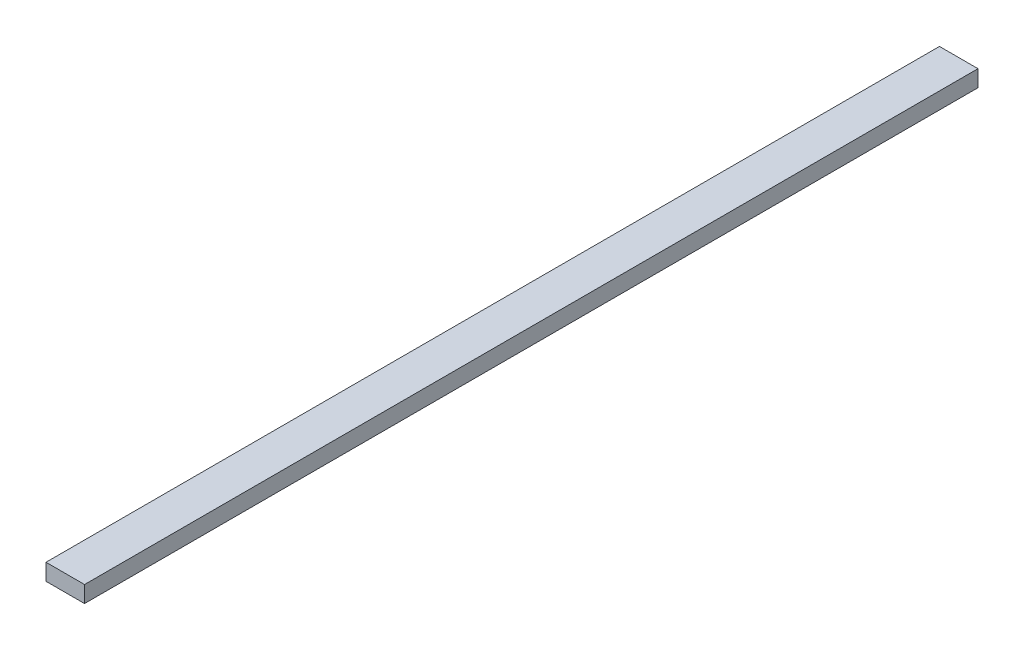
from build123d import *

# Parameters (mm, degrees)
SKETCH1_W           = 88.9
SKETCH1_H           = 2060.575
BOSS_EXTRUDE1_DEPTH = 38.1


with BuildPart() as part:
    # Sketch1 → Boss-Extrude1 (new body)
    with BuildSketch(Plane(origin=(0, 0, 0), x_dir=(1, 0, 0), z_dir=(0, 1, 0))):
        with Locations((-44.45, -1030.2875)):
            Rectangle(SKETCH1_W, SKETCH1_H)
    extrude(amount=BOSS_EXTRUDE1_DEPTH)


solid = part.part
